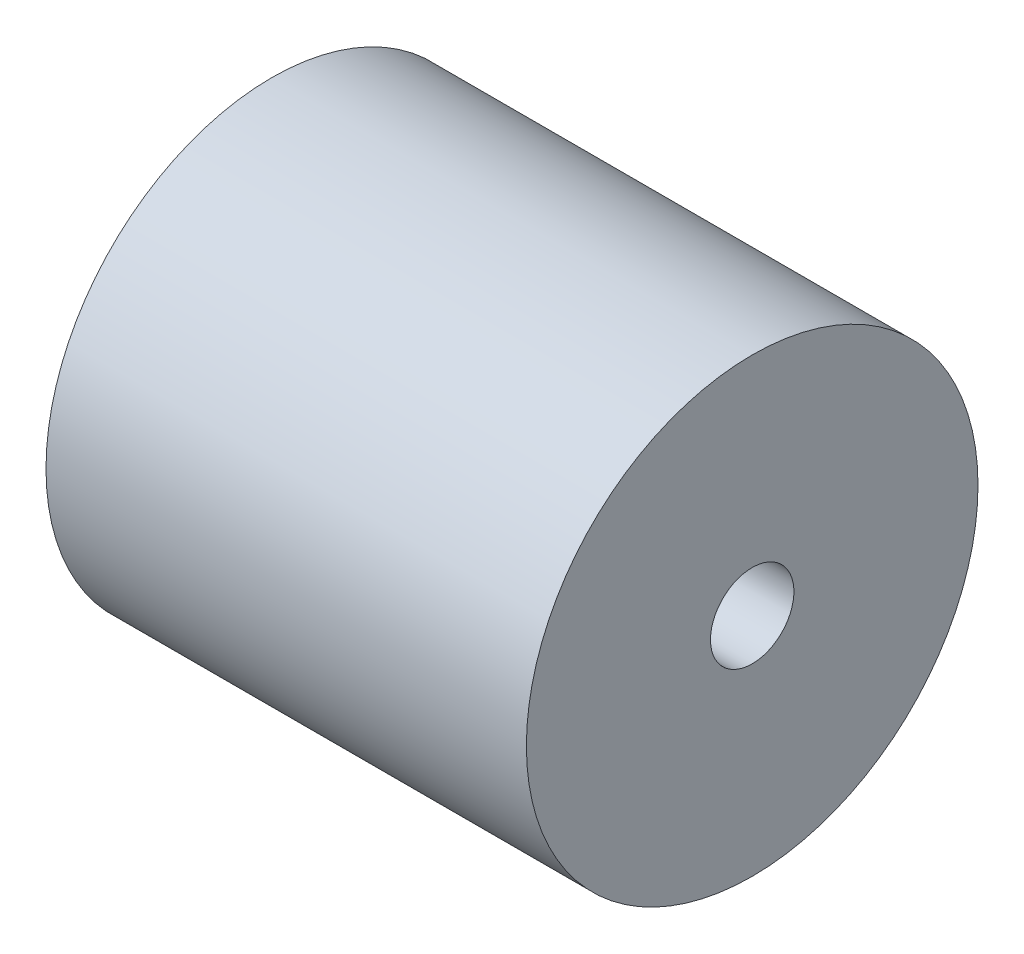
from build123d import *


with BuildPart() as part:
    # Skizze1 → Rotation1 (revolve)
    with BuildSketch(Plane.XY, mode=Mode.PRIVATE) as rotation1_sk:
        Polygon((-18.601864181, 8.78828229), (30.665778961, 8.78828229), (32.796271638, 5.85885486), (49.840213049, 5.85885486), (52.403462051, 7.723035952), (70.34620506, 7.723035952), (70.34620506, 41.810918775), (-18.601864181, 41.810918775), align=None)
    revolve(rotation1_sk.sketch.rotate(Axis((0, 0, 0), (1, 0, 0)), 90), axis=Axis((0, 0, 0), (1, 0, 0)))


solid = part.part
